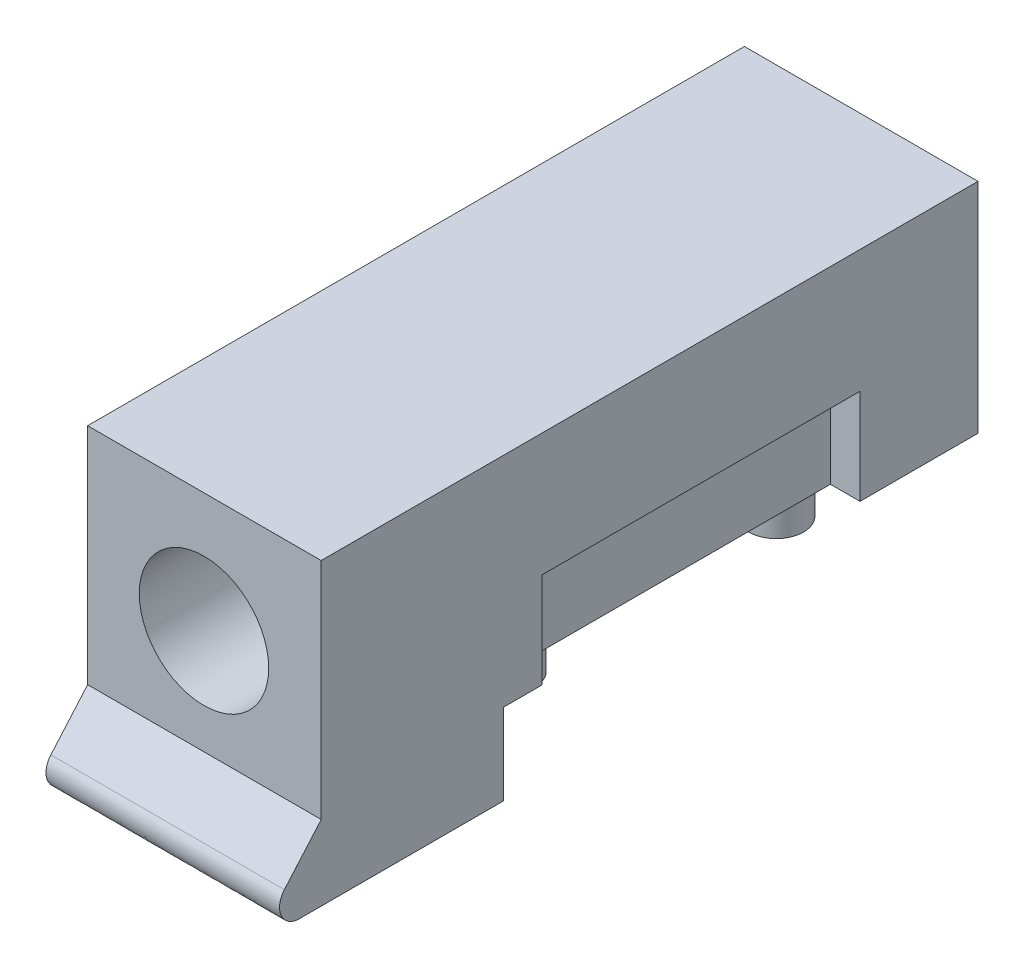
ISO-10303-21;
HEADER;
FILE_DESCRIPTION(('STEP AP214'),'2;1');
FILE_NAME('part.step','',(''),(''),'','','');
FILE_SCHEMA(('AUTOMOTIVE_DESIGN { 1 0 10303 214 1 1 1 1 }'));
ENDSEC;
DATA;
#1=APPLICATION_CONTEXT('core data for automotive mechanical design processes');
#2=APPLICATION_PROTOCOL_DEFINITION('international standard','automotive_design',2000,#1);
#3=PRODUCT_CONTEXT('',#1,'mechanical');
#4=PRODUCT('Part','Part','',(#3));
#5=PRODUCT_RELATED_PRODUCT_CATEGORY('part','',(#4));
#6=PRODUCT_DEFINITION_FORMATION('','',#4);
#7=PRODUCT_DEFINITION_CONTEXT('part definition',#1,'design');
#8=PRODUCT_DEFINITION('design','',#6,#7);
#9=PRODUCT_DEFINITION_SHAPE('','',#8);
#10=(LENGTH_UNIT() NAMED_UNIT(*) SI_UNIT(.MILLI.,.METRE.));
#11=(NAMED_UNIT(*) PLANE_ANGLE_UNIT() SI_UNIT($,.RADIAN.));
#12=(NAMED_UNIT(*) SI_UNIT($,.STERADIAN.) SOLID_ANGLE_UNIT());
#13=UNCERTAINTY_MEASURE_WITH_UNIT(LENGTH_MEASURE(1.E-05),#10,'distance_accuracy_value','');
#14=(GEOMETRIC_REPRESENTATION_CONTEXT(3) GLOBAL_UNCERTAINTY_ASSIGNED_CONTEXT((#13)) GLOBAL_UNIT_ASSIGNED_CONTEXT((#10,
#11,#12)) REPRESENTATION_CONTEXT('',''));
#15=CARTESIAN_POINT('',(0.,0.,0.));
#16=DIRECTION('',(0.,0.,1.));
#17=DIRECTION('',(1.,0.,0.));
#18=AXIS2_PLACEMENT_3D('',#15,#16,#17);
#19=CARTESIAN_POINT('',(-5.518,0.,-62.0626));
#20=DIRECTION('',(0.,1.,0.));
#21=DIRECTION('',(0.,0.,1.));
#22=AXIS2_PLACEMENT_3D('',#19,#20,#21);
#23=PLANE('',#22);
#24=CARTESIAN_POINT('',(0.,0.,-51.13));
#25=DIRECTION('',(0.,-1.,0.));
#26=DIRECTION('',(0.,0.,-1.));
#27=AXIS2_PLACEMENT_3D('',#24,#25,#26);
#28=CIRCLE('',#27,1.);
#29=CARTESIAN_POINT('',(0.,0.,-52.13));
#30=VERTEX_POINT('',#29);
#31=EDGE_CURVE('E553',#30,#30,#28,.T.);
#32=ORIENTED_EDGE('',*,*,#31,.F.);
#33=EDGE_LOOP('',(#32));
#34=FACE_BOUND('',#33,.T.);
#35=CARTESIAN_POINT('',(0.0200000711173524,0.,-45.5));
#36=DIRECTION('',(0.,1.,0.));
#37=DIRECTION('',(0.,0.,1.));
#38=AXIS2_PLACEMENT_3D('',#35,#36,#37);
#39=CIRCLE('',#38,1.25);
#40=CARTESIAN_POINT('',(0.0200000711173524,0.,-44.25));
#41=VERTEX_POINT('',#40);
#42=EDGE_CURVE('E44',#41,#41,#39,.F.);
#43=ORIENTED_EDGE('',*,*,#42,.F.);
#44=EDGE_LOOP('',(#43));
#45=FACE_BOUND('',#44,.T.);
#46=DIRECTION('',(1.,0.,0.));
#47=VECTOR('',#46,1.);
#48=CARTESIAN_POINT('',(-4.63,0.,-41.75));
#49=LINE('',#48,#47);
#50=CARTESIAN_POINT('',(-5.305,0.,-41.75));
#51=VERTEX_POINT('',#50);
#52=CARTESIAN_POINT('',(-3.955,0.,-41.75));
#53=VERTEX_POINT('',#52);
#54=EDGE_CURVE('E278',#51,#53,#49,.T.);
#55=ORIENTED_EDGE('',*,*,#54,.T.);
#56=DIRECTION('',(0.,0.,1.));
#57=VECTOR('',#56,1.);
#58=CARTESIAN_POINT('',(-3.955,0.,-50.815));
#59=LINE('',#58,#57);
#60=CARTESIAN_POINT('',(-3.955,0.,-56.25));
#61=VERTEX_POINT('',#60);
#62=EDGE_CURVE('E247',#61,#53,#59,.T.);
#63=ORIENTED_EDGE('',*,*,#62,.F.);
#64=DIRECTION('',(1.,0.,0.));
#65=VECTOR('',#64,1.);
#66=CARTESIAN_POINT('',(-4.63,0.,-56.25));
#67=LINE('',#66,#65);
#68=CARTESIAN_POINT('',(-5.305,0.,-56.25));
#69=VERTEX_POINT('',#68);
#70=EDGE_CURVE('E435',#61,#69,#67,.F.);
#71=ORIENTED_EDGE('',*,*,#70,.T.);
#72=DIRECTION('',(0.,0.,1.));
#73=VECTOR('',#72,1.);
#74=CARTESIAN_POINT('',(-5.305,0.,-50.815));
#75=LINE('',#74,#73);
#76=CARTESIAN_POINT('',(-5.305,0.,-61.63));
#77=VERTEX_POINT('',#76);
#78=EDGE_CURVE('E417',#77,#69,#75,.T.);
#79=ORIENTED_EDGE('',*,*,#78,.F.);
#80=DIRECTION('',(-1.,0.,0.));
#81=VECTOR('',#80,1.);
#82=CARTESIAN_POINT('',(0.0200000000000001,0.,-61.63));
#83=LINE('',#82,#81);
#84=CARTESIAN_POINT('',(5.345,0.,-61.63));
#85=VERTEX_POINT('',#84);
#86=EDGE_CURVE('E237',#85,#77,#83,.T.);
#87=ORIENTED_EDGE('',*,*,#86,.F.);
#88=DIRECTION('',(0.,0.,-1.));
#89=VECTOR('',#88,1.);
#90=CARTESIAN_POINT('',(5.345,0.,-45.705));
#91=LINE('',#90,#89);
#92=CARTESIAN_POINT('',(5.345,0.,-56.25));
#93=VERTEX_POINT('',#92);
#94=EDGE_CURVE('E60',#85,#93,#91,.F.);
#95=ORIENTED_EDGE('',*,*,#94,.T.);
#96=DIRECTION('',(1.,0.,0.));
#97=VECTOR('',#96,1.);
#98=CARTESIAN_POINT('',(4.67,0.,-56.25));
#99=LINE('',#98,#97);
#100=CARTESIAN_POINT('',(3.995,0.,-56.25));
#101=VERTEX_POINT('',#100);
#102=EDGE_CURVE('E190',#93,#101,#99,.F.);
#103=ORIENTED_EDGE('',*,*,#102,.T.);
#104=DIRECTION('',(0.,0.,-1.));
#105=VECTOR('',#104,1.);
#106=CARTESIAN_POINT('',(3.995,0.,-50.815));
#107=LINE('',#106,#105);
#108=CARTESIAN_POINT('',(3.995,0.,-41.75));
#109=VERTEX_POINT('',#108);
#110=EDGE_CURVE('E197',#109,#101,#107,.T.);
#111=ORIENTED_EDGE('',*,*,#110,.F.);
#112=DIRECTION('',(-1.,0.,0.));
#113=VECTOR('',#112,1.);
#114=CARTESIAN_POINT('',(0.0199999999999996,0.,-41.75));
#115=LINE('',#114,#113);
#116=CARTESIAN_POINT('',(5.345,0.,-41.75));
#117=VERTEX_POINT('',#116);
#118=EDGE_CURVE('E194',#117,#109,#115,.T.);
#119=ORIENTED_EDGE('',*,*,#118,.F.);
#120=DIRECTION('',(0.,0.,-1.));
#121=VECTOR('',#120,1.);
#122=CARTESIAN_POINT('',(5.345,0.,-45.705));
#123=LINE('',#122,#121);
#124=CARTESIAN_POINT('',(5.345,0.,-40.));
#125=VERTEX_POINT('',#124);
#126=EDGE_CURVE('E180',#117,#125,#123,.F.);
#127=ORIENTED_EDGE('',*,*,#126,.T.);
#128=DIRECTION('',(1.,0.,0.));
#129=VECTOR('',#128,1.);
#130=CARTESIAN_POINT('',(0.0199999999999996,0.,-40.));
#131=LINE('',#130,#129);
#132=CARTESIAN_POINT('',(-5.305,0.,-40.));
#133=VERTEX_POINT('',#132);
#134=EDGE_CURVE('E188',#133,#125,#131,.T.);
#135=ORIENTED_EDGE('',*,*,#134,.F.);
#136=DIRECTION('',(0.,0.,1.));
#137=VECTOR('',#136,1.);
#138=CARTESIAN_POINT('',(-5.305,0.,-50.815));
#139=LINE('',#138,#137);
#140=EDGE_CURVE('E191',#51,#133,#139,.T.);
#141=ORIENTED_EDGE('',*,*,#140,.F.);
#142=EDGE_LOOP('',(#55,#63,#71,#79,#87,#95,#103,#111,#119,#127,#135,#141));
#143=FACE_BOUND('',#142,.T.);
#144=CARTESIAN_POINT('',(0.0200000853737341,0.,-57.75));
#145=DIRECTION('',(0.,1.,0.));
#146=DIRECTION('',(0.,0.,1.));
#147=AXIS2_PLACEMENT_3D('',#144,#145,#146);
#148=CIRCLE('',#147,1.25);
#149=CARTESIAN_POINT('',(0.0200000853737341,0.,-56.5));
#150=VERTEX_POINT('',#149);
#151=EDGE_CURVE('E11',#150,#150,#148,.F.);
#152=ORIENTED_EDGE('',*,*,#151,.F.);
#153=EDGE_LOOP('',(#152));
#154=FACE_BOUND('',#153,.T.);
#155=ADVANCED_FACE('F30',(#34,#45,#143,#154),#23,.F.);
#156=CARTESIAN_POINT('',(-5.351126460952,4.35,-41.46));
#157=DIRECTION('',(0.,1.,0.));
#158=DIRECTION('',(1.,0.,0.));
#159=AXIS2_PLACEMENT_3D('',#156,#157,#158);
#160=PLANE('',#159);
#161=DIRECTION('',(0.,0.,1.));
#162=VECTOR('',#161,1.);
#163=CARTESIAN_POINT('',(-3.955,4.35,-49.));
#164=LINE('',#163,#162);
#165=CARTESIAN_POINT('',(-3.955,4.35,-56.25));
#166=VERTEX_POINT('',#165);
#167=CARTESIAN_POINT('',(-3.955,4.35,-41.75));
#168=VERTEX_POINT('',#167);
#169=EDGE_CURVE('E413',#166,#168,#164,.T.);
#170=ORIENTED_EDGE('',*,*,#169,.T.);
#171=DIRECTION('',(-1.,0.,0.));
#172=VECTOR('',#171,1.);
#173=CARTESIAN_POINT('',(-4.63,4.35,-41.75));
#174=LINE('',#173,#172);
#175=CARTESIAN_POINT('',(-5.305,4.35,-41.75));
#176=VERTEX_POINT('',#175);
#177=EDGE_CURVE('E443',#168,#176,#174,.T.);
#178=ORIENTED_EDGE('',*,*,#177,.T.);
#179=DIRECTION('',(0.,0.,-1.));
#180=VECTOR('',#179,1.);
#181=CARTESIAN_POINT('',(-5.305,4.35,-45.705));
#182=LINE('',#181,#180);
#183=CARTESIAN_POINT('',(-5.305,4.35,-56.25));
#184=VERTEX_POINT('',#183);
#185=EDGE_CURVE('E422',#176,#184,#182,.T.);
#186=ORIENTED_EDGE('',*,*,#185,.T.);
#187=DIRECTION('',(-1.,0.,0.));
#188=VECTOR('',#187,1.);
#189=CARTESIAN_POINT('',(-4.63,4.35,-56.25));
#190=LINE('',#189,#188);
#191=EDGE_CURVE('E433',#184,#166,#190,.F.);
#192=ORIENTED_EDGE('',*,*,#191,.T.);
#193=EDGE_LOOP('',(#170,#178,#186,#192));
#194=FACE_BOUND('',#193,.T.);
#195=ADVANCED_FACE('F271',(#194),#160,.F.);
#196=CARTESIAN_POINT('',(-5.351126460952,-0.087,-56.25));
#197=DIRECTION('',(0.,0.,1.));
#198=DIRECTION('',(1.,0.,0.));
#199=AXIS2_PLACEMENT_3D('',#196,#197,#198);
#200=PLANE('',#199);
#201=DIRECTION('',(0.,1.,0.));
#202=VECTOR('',#201,1.);
#203=CARTESIAN_POINT('',(-3.955,2.175,-56.25));
#204=LINE('',#203,#202);
#205=EDGE_CURVE('E410',#61,#166,#204,.T.);
#206=ORIENTED_EDGE('',*,*,#205,.T.);
#207=ORIENTED_EDGE('',*,*,#191,.F.);
#208=DIRECTION('',(0.,-1.,0.));
#209=VECTOR('',#208,1.);
#210=CARTESIAN_POINT('',(-5.305,5.5,-56.25));
#211=LINE('',#210,#209);
#212=EDGE_CURVE('E428',#184,#69,#211,.T.);
#213=ORIENTED_EDGE('',*,*,#212,.T.);
#214=ORIENTED_EDGE('',*,*,#70,.F.);
#215=EDGE_LOOP('',(#206,#207,#213,#214));
#216=FACE_BOUND('',#215,.T.);
#217=ADVANCED_FACE('F311',(#216),#200,.T.);
#218=CARTESIAN_POINT('',(-3.908873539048,4.437,-41.75));
#219=DIRECTION('',(0.,0.,1.));
#220=DIRECTION('',(-1.,0.,0.));
#221=AXIS2_PLACEMENT_3D('',#218,#219,#220);
#222=PLANE('',#221);
#223=DIRECTION('',(0.,-1.,0.));
#224=VECTOR('',#223,1.);
#225=CARTESIAN_POINT('',(-3.955,2.175,-41.75));
#226=LINE('',#225,#224);
#227=EDGE_CURVE('E420',#168,#53,#226,.T.);
#228=ORIENTED_EDGE('',*,*,#227,.T.);
#229=ORIENTED_EDGE('',*,*,#54,.F.);
#230=DIRECTION('',(0.,1.,0.));
#231=VECTOR('',#230,1.);
#232=CARTESIAN_POINT('',(-5.305,5.5,-41.75));
#233=LINE('',#232,#231);
#234=EDGE_CURVE('E227',#51,#176,#233,.T.);
#235=ORIENTED_EDGE('',*,*,#234,.T.);
#236=ORIENTED_EDGE('',*,*,#177,.F.);
#237=EDGE_LOOP('',(#228,#229,#235,#236));
#238=FACE_BOUND('',#237,.T.);
#239=ADVANCED_FACE('F315',(#238),#222,.F.);
#240=CARTESIAN_POINT('',(5.558,-3.698818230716,-30.72610626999));
#241=CARTESIAN_POINT('',(1.866,-3.698818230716,-30.72610626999));
#242=CARTESIAN_POINT('',(-1.826,-3.698818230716,-30.72610626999));
#243=CARTESIAN_POINT('',(-5.518,-3.698818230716,-30.72610626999));
#244=CARTESIAN_POINT('',(5.558,-3.703407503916,-30.63664072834));
#245=CARTESIAN_POINT('',(1.866,-3.703407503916,-30.63664072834));
#246=CARTESIAN_POINT('',(-1.826,-3.703407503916,-30.63664072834));
#247=CARTESIAN_POINT('',(-5.518,-3.703407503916,-30.63664072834));
#248=CARTESIAN_POINT('',(5.558,-3.685670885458,-30.45634286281));
#249=CARTESIAN_POINT('',(1.866,-3.685670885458,-30.45634286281));
#250=CARTESIAN_POINT('',(-1.826,-3.685670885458,-30.45634286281));
#251=CARTESIAN_POINT('',(-5.518,-3.685670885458,-30.45634286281));
#252=CARTESIAN_POINT('',(5.558,-3.580677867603,-30.20568047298));
#253=CARTESIAN_POINT('',(1.866,-3.580677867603,-30.20568047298));
#254=CARTESIAN_POINT('',(-1.826,-3.580677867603,-30.20568047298));
#255=CARTESIAN_POINT('',(-5.518,-3.580677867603,-30.20568047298));
#256=CARTESIAN_POINT('',(5.558,-3.40658871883,-29.99700194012));
#257=CARTESIAN_POINT('',(1.866,-3.40658871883,-29.99700194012));
#258=CARTESIAN_POINT('',(-1.826,-3.40658871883,-29.99700194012));
#259=CARTESIAN_POINT('',(-5.518,-3.40658871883,-29.99700194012));
#260=CARTESIAN_POINT('',(5.558,-3.178811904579,-29.84877313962));
#261=CARTESIAN_POINT('',(1.866,-3.178811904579,-29.84877313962));
#262=CARTESIAN_POINT('',(-1.826,-3.178811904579,-29.84877313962));
#263=CARTESIAN_POINT('',(-5.518,-3.178811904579,-29.84877313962));
#264=CARTESIAN_POINT('',(5.558,-2.917507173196,-29.77411463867));
#265=CARTESIAN_POINT('',(1.866,-2.917507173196,-29.77411463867));
#266=CARTESIAN_POINT('',(-1.826,-2.917507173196,-29.77411463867));
#267=CARTESIAN_POINT('',(-5.518,-2.917507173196,-29.77411463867));
#268=CARTESIAN_POINT('',(5.558,-2.645802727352,-29.77963332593));
#269=CARTESIAN_POINT('',(1.866,-2.645802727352,-29.77963332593));
#270=CARTESIAN_POINT('',(-1.826,-2.645802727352,-29.77963332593));
#271=CARTESIAN_POINT('',(-5.518,-2.645802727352,-29.77963332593));
#272=CARTESIAN_POINT('',(5.558,-2.387743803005,-29.86484341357));
#273=CARTESIAN_POINT('',(1.866,-2.387743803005,-29.86484341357));
#274=CARTESIAN_POINT('',(-1.826,-2.387743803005,-29.86484341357));
#275=CARTESIAN_POINT('',(-5.518,-2.387743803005,-29.86484341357));
#276=CARTESIAN_POINT('',(5.558,-2.240035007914,-29.96974346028));
#277=CARTESIAN_POINT('',(1.866,-2.240035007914,-29.96974346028));
#278=CARTESIAN_POINT('',(-1.826,-2.240035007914,-29.96974346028));
#279=CARTESIAN_POINT('',(-5.518,-2.240035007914,-29.96974346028));
#280=CARTESIAN_POINT('',(5.558,-2.17552534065,-30.03190170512));
#281=CARTESIAN_POINT('',(1.866,-2.17552534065,-30.03190170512));
#282=CARTESIAN_POINT('',(-1.826,-2.17552534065,-30.03190170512));
#283=CARTESIAN_POINT('',(-5.518,-2.17552534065,-30.03190170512));
#284=B_SPLINE_SURFACE_WITH_KNOTS('',3,3,((#240,#241,#242,#243),(#244,#245,#246,#247),(#248,#249,
#250,#251),(#252,#253,#254,#255),(#256,#257,#258,#259),(#260,#261,#262,#263),(#264,#265,#266,
#267),(#268,#269,#270,#271),(#272,#273,#274,#275),(#276,#277,#278,#279),(#280,#281,#282,#283)),
.UNSPECIFIED.,.F.,.F.,.F.,(4,1,1,1,1,1,1,1,4),(4,4),(4.661137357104,4.959747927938,
5.258358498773,5.556969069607,5.855579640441,6.154190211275,6.452800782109,6.751411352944,
7.050021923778),(0.,11.076),.UNSPECIFIED.);
#285=CARTESIAN_POINT('',(5.558,-2.20955085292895,-30.0007659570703));
#286=CARTESIAN_POINT('',(1.866,-2.20955085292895,-30.0007659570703));
#287=CARTESIAN_POINT('',(-1.826,-2.20955085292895,-30.0007659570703));
#288=CARTESIAN_POINT('',(-5.518,-2.20955085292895,-30.0007659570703));
#289=B_SPLINE_CURVE_WITH_KNOTS('',3,(#285,#286,#287,#288),.UNSPECIFIED.,.F.,.F.,(4,4),(0.,
11.076),.UNSPECIFIED.);
#290=CARTESIAN_POINT('',(5.345,-2.20954886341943,-30.0007636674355));
#291=VERTEX_POINT('',#290);
#292=CARTESIAN_POINT('',(-5.305,-2.20954886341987,-30.000763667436));
#293=VERTEX_POINT('',#292);
#294=EDGE_CURVE('E146',#291,#293,#289,.T.);
#295=CARTESIAN_POINT('',(-5.305,-2.20955085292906,-30.0007659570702));
#296=CARTESIAN_POINT('',(-5.305,-2.22864470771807,-29.9841754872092));
#297=CARTESIAN_POINT('',(-5.305,-2.2484373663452,-29.9683911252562));
#298=CARTESIAN_POINT('',(-5.305,-2.28927631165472,-29.9385380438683));
#299=CARTESIAN_POINT('',(-5.305,-2.31032257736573,-29.924469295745));
#300=CARTESIAN_POINT('',(-5.305,-2.35357081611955,-29.8981226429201));
#301=CARTESIAN_POINT('',(-5.305,-2.3757751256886,-29.8858485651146));
#302=CARTESIAN_POINT('',(-5.305,-2.42113949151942,-29.8632346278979));
#303=CARTESIAN_POINT('',(-5.305,-2.44429950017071,-29.8528946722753));
#304=CARTESIAN_POINT('',(-5.305,-2.5149818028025,-29.8248429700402));
#305=CARTESIAN_POINT('',(-5.305,-2.56371636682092,-29.8100933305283));
#306=CARTESIAN_POINT('',(-5.305,-2.66283289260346,-29.7890814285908));
#307=CARTESIAN_POINT('',(-5.305,-2.71320884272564,-29.7827911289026));
#308=CARTESIAN_POINT('',(-5.305,-2.77577573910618,-29.7802626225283));
#309=CARTESIAN_POINT('',(-5.305,-2.78788468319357,-29.780018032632));
#310=CARTESIAN_POINT('',(-5.305,-2.85046925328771,-29.7800192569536));
#311=CARTESIAN_POINT('',(-5.305,-2.90104911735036,-29.7842688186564));
#312=CARTESIAN_POINT('',(-5.305,-2.97580043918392,-29.7969783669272));
#313=CARTESIAN_POINT('',(-5.305,-3.00057006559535,-29.8022844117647));
#314=CARTESIAN_POINT('',(-5.305,-3.04959531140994,-29.8149529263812));
#315=CARTESIAN_POINT('',(-5.305,-3.07385066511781,-29.8223164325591));
#316=CARTESIAN_POINT('',(-5.305,-3.14542713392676,-29.8474068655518));
#317=CARTESIAN_POINT('',(-5.305,-3.19172441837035,-29.8681619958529));
#318=CARTESIAN_POINT('',(-5.305,-3.2802421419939,-29.9171657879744));
#319=CARTESIAN_POINT('',(-5.305,-3.32245542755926,-29.9454272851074));
#320=CARTESIAN_POINT('',(-5.305,-3.40155107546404,-30.0086693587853));
#321=CARTESIAN_POINT('',(-5.305,-3.43843056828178,-30.0436535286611));
#322=CARTESIAN_POINT('',(-5.305,-3.50574845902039,-30.1192421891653));
#323=CARTESIAN_POINT('',(-5.305,-3.53619779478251,-30.1598369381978));
#324=CARTESIAN_POINT('',(-5.305,-3.589843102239,-30.2455974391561));
#325=CARTESIAN_POINT('',(-5.305,-3.61303428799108,-30.2907661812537));
#326=CARTESIAN_POINT('',(-5.305,-3.65153143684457,-30.3843377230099));
#327=CARTESIAN_POINT('',(-5.305,-3.66684156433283,-30.4327387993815));
#328=CARTESIAN_POINT('',(-5.305,-3.68528292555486,-30.5145326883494));
#329=CARTESIAN_POINT('',(-5.305,-3.69078744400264,-30.5474093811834));
#330=CARTESIAN_POINT('',(-5.305,-3.69813347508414,-30.613520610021));
#331=CARTESIAN_POINT('',(-5.305,-3.69998039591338,-30.646754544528));
#332=CARTESIAN_POINT('',(-5.305,-3.69999393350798,-30.680000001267));
#333=B_SPLINE_CURVE_WITH_KNOTS('',3,(#295,#296,#297,#298,#299,#300,#301,#302,#303,#304,#305,
#306,#307,#308,#309,#310,#311,#312,#313,#314,#315,#316,#317,#318,#319,#320,#321,#322,#323,#324,
#325,#326,#327,#328,#329,#330,#331,#332),.UNSPECIFIED.,.F.,.F.,(4,2,2,2,2,2,2,2,2,2,2,2,2,2,2,2,
2,2,4),(0.,0.0758594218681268,0.151717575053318,0.227735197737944,0.303749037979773,
0.455742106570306,0.607230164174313,0.643565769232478,0.794930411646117,0.87085735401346,
0.946822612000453,1.0982551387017,1.24994828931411,1.40172274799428,1.55323691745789,
1.70485078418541,1.85638445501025,1.95619626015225,2.05586037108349),.UNSPECIFIED.);
#334=CARTESIAN_POINT('',(-5.305,-3.69999696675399,-30.6800000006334));
#335=VERTEX_POINT('',#334);
#336=EDGE_CURVE('E252',#293,#335,#333,.T.);
#337=CARTESIAN_POINT('',(-5.518,-3.69999393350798,-30.6800000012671));
#338=CARTESIAN_POINT('',(-1.826,-3.69999393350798,-30.6800000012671));
#339=CARTESIAN_POINT('',(1.866,-3.69999393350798,-30.6800000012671));
#340=CARTESIAN_POINT('',(5.558,-3.69999393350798,-30.6800000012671));
#341=B_SPLINE_CURVE_WITH_KNOTS('',3,(#337,#338,#339,#340),.UNSPECIFIED.,.F.,.F.,(4,4),(0.,
11.076),.UNSPECIFIED.);
#342=CARTESIAN_POINT('',(5.345,-3.69999696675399,-30.6800000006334));
#343=VERTEX_POINT('',#342);
#344=EDGE_CURVE('E407',#335,#343,#341,.T.);
#345=CARTESIAN_POINT('',(5.345,-2.20955085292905,-30.0007659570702));
#346=CARTESIAN_POINT('',(5.345,-2.22864470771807,-29.9841754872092));
#347=CARTESIAN_POINT('',(5.345,-2.24843736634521,-29.9683911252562));
#348=CARTESIAN_POINT('',(5.345,-2.28927631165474,-29.9385380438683));
#349=CARTESIAN_POINT('',(5.345,-2.31032257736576,-29.924469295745));
#350=CARTESIAN_POINT('',(5.345,-2.3535708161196,-29.89812264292));
#351=CARTESIAN_POINT('',(5.345,-2.37577512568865,-29.8858485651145));
#352=CARTESIAN_POINT('',(5.345,-2.42113949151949,-29.8632346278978));
#353=CARTESIAN_POINT('',(5.345,-2.44429950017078,-29.8528946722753));
#354=CARTESIAN_POINT('',(5.345,-2.5149818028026,-29.8248429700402));
#355=CARTESIAN_POINT('',(5.345,-2.56371636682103,-29.8100933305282));
#356=CARTESIAN_POINT('',(5.345,-2.66283289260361,-29.7890814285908));
#357=CARTESIAN_POINT('',(5.345,-2.7132088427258,-29.7827911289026));
#358=CARTESIAN_POINT('',(5.345,-2.7757757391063,-29.7802626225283));
#359=CARTESIAN_POINT('',(5.345,-2.78788468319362,-29.780018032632));
#360=CARTESIAN_POINT('',(5.345,-2.85046925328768,-29.7800192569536));
#361=CARTESIAN_POINT('',(5.345,-2.90104911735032,-29.7842688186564));
#362=CARTESIAN_POINT('',(5.345,-2.97580043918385,-29.7969783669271));
#363=CARTESIAN_POINT('',(5.345,-3.00057006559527,-29.8022844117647));
#364=CARTESIAN_POINT('',(5.345,-3.04959531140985,-29.8149529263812));
#365=CARTESIAN_POINT('',(5.345,-3.07385066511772,-29.8223164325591));
#366=CARTESIAN_POINT('',(5.345,-3.14542713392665,-29.8474068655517));
#367=CARTESIAN_POINT('',(5.345,-3.19172441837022,-29.8681619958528));
#368=CARTESIAN_POINT('',(5.345,-3.28024214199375,-29.9171657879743));
#369=CARTESIAN_POINT('',(5.345,-3.32245542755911,-29.9454272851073));
#370=CARTESIAN_POINT('',(5.345,-3.40155107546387,-30.0086693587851));
#371=CARTESIAN_POINT('',(5.345,-3.43843056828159,-30.0436535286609));
#372=CARTESIAN_POINT('',(5.345,-3.50574845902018,-30.1192421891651));
#373=CARTESIAN_POINT('',(5.345,-3.5361977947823,-30.1598369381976));
#374=CARTESIAN_POINT('',(5.345,-3.58984310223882,-30.2455974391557));
#375=CARTESIAN_POINT('',(5.345,-3.61303428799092,-30.2907661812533));
#376=CARTESIAN_POINT('',(5.345,-3.65153143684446,-30.3843377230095));
#377=CARTESIAN_POINT('',(5.345,-3.66684156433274,-30.4327387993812));
#378=CARTESIAN_POINT('',(5.345,-3.68528292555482,-30.5145326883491));
#379=CARTESIAN_POINT('',(5.345,-3.69078744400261,-30.5474093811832));
#380=CARTESIAN_POINT('',(5.345,-3.69813347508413,-30.6135206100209));
#381=CARTESIAN_POINT('',(5.345,-3.69998039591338,-30.646754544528));
#382=CARTESIAN_POINT('',(5.345,-3.69999393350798,-30.680000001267));
#383=B_SPLINE_CURVE_WITH_KNOTS('',3,(#345,#346,#347,#348,#349,#350,#351,#352,#353,#354,#355,
#356,#357,#358,#359,#360,#361,#362,#363,#364,#365,#366,#367,#368,#369,#370,#371,#372,#373,#374,
#375,#376,#377,#378,#379,#380,#381,#382),.UNSPECIFIED.,.F.,.F.,(4,2,2,2,2,2,2,2,2,2,2,2,2,2,2,2,
2,2,4),(0.,0.0758594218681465,0.151717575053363,0.227735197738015,0.303749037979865,
0.455742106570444,0.607230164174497,0.643565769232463,0.794930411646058,0.870857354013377,
0.946822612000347,1.09825513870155,1.24994828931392,1.40172274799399,1.5532369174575,
1.70485078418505,1.85638445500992,1.95619626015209,2.0558603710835),.UNSPECIFIED.);
#384=EDGE_CURVE('E355',#291,#343,#383,.T.);
#385=ORIENTED_EDGE('',*,*,#294,.T.);
#386=ORIENTED_EDGE('',*,*,#336,.T.);
#387=ORIENTED_EDGE('',*,*,#344,.T.);
#388=ORIENTED_EDGE('',*,*,#384,.F.);
#389=EDGE_LOOP('',(#385,#386,#387,#388));
#390=FACE_BOUND('',#389,.T.);
#391=ADVANCED_FACE('F319',(#390),#284,.T.);
#392=CARTESIAN_POINT('',(-3.955,4.437,-56.54));
#393=DIRECTION('',(1.,0.,0.));
#394=DIRECTION('',(0.,0.,1.));
#395=AXIS2_PLACEMENT_3D('',#392,#393,#394);
#396=PLANE('',#395);
#397=ORIENTED_EDGE('',*,*,#169,.F.);
#398=ORIENTED_EDGE('',*,*,#205,.F.);
#399=ORIENTED_EDGE('',*,*,#62,.T.);
#400=ORIENTED_EDGE('',*,*,#227,.F.);
#401=EDGE_LOOP('',(#397,#398,#399,#400));
#402=FACE_BOUND('',#401,.T.);
#403=ADVANCED_FACE('F326',(#402),#396,.F.);
#404=CARTESIAN_POINT('',(-5.305,15.068,-62.267));
#405=DIRECTION('',(1.,0.,0.));
#406=DIRECTION('',(0.,0.,1.));
#407=AXIS2_PLACEMENT_3D('',#404,#405,#406);
#408=PLANE('',#407);
#409=DIRECTION('',(0.,-1.,0.));
#410=VECTOR('',#409,1.);
#411=CARTESIAN_POINT('',(-5.305,5.49999999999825,-31.68));
#412=LINE('',#411,#410);
#413=CARTESIAN_POINT('',(-5.305,-0.277803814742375,-31.679999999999));
#414=VERTEX_POINT('',#413);
#415=CARTESIAN_POINT('',(-5.305,9.95,-31.68));
#416=VERTEX_POINT('',#415);
#417=EDGE_CURVE('E157',#414,#416,#412,.F.);
#418=ORIENTED_EDGE('',*,*,#417,.T.);
#419=DIRECTION('',(0.,0.,1.));
#420=VECTOR('',#419,1.);
#421=CARTESIAN_POINT('',(-5.305,9.95,-68.2273435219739));
#422=LINE('',#421,#420);
#423=CARTESIAN_POINT('',(-5.305,9.95,-61.63));
#424=VERTEX_POINT('',#423);
#425=EDGE_CURVE('E469',#424,#416,#422,.T.);
#426=ORIENTED_EDGE('',*,*,#425,.F.);
#427=DIRECTION('',(0.,-1.,0.));
#428=VECTOR('',#427,1.);
#429=CARTESIAN_POINT('',(-5.305,7.35,-61.63));
#430=LINE('',#429,#428);
#431=EDGE_CURVE('E198',#424,#77,#430,.T.);
#432=ORIENTED_EDGE('',*,*,#431,.T.);
#433=ORIENTED_EDGE('',*,*,#78,.T.);
#434=ORIENTED_EDGE('',*,*,#212,.F.);
#435=ORIENTED_EDGE('',*,*,#185,.F.);
#436=ORIENTED_EDGE('',*,*,#234,.F.);
#437=ORIENTED_EDGE('',*,*,#140,.T.);
#438=DIRECTION('',(0.,-1.,0.));
#439=VECTOR('',#438,1.);
#440=CARTESIAN_POINT('',(-5.305,-1.85,-40.));
#441=LINE('',#440,#439);
#442=CARTESIAN_POINT('',(-5.305,-3.7,-40.));
#443=VERTEX_POINT('',#442);
#444=EDGE_CURVE('E175',#133,#443,#441,.T.);
#445=ORIENTED_EDGE('',*,*,#444,.T.);
#446=DIRECTION('',(0.,0.,1.));
#447=VECTOR('',#446,1.);
#448=CARTESIAN_POINT('',(-5.305,-3.7,-35.34));
#449=LINE('',#448,#447);
#450=EDGE_CURVE('E174',#443,#335,#449,.T.);
#451=ORIENTED_EDGE('',*,*,#450,.T.);
#452=ORIENTED_EDGE('',*,*,#336,.F.);
#453=DIRECTION('',(0.,-0.754709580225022,0.656059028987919));
#454=VECTOR('',#453,1.);
#455=CARTESIAN_POINT('',(-5.305,-1.24367534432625,-30.8403806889));
#456=LINE('',#455,#454);
#457=EDGE_CURVE('E158',#293,#414,#456,.F.);
#458=ORIENTED_EDGE('',*,*,#457,.T.);
#459=EDGE_LOOP('',(#418,#426,#432,#433,#434,#435,#436,#437,#445,#451,#452,#458));
#460=FACE_BOUND('',#459,.T.);
#461=ADVANCED_FACE('F356',(#460),#408,.F.);
#462=CARTESIAN_POINT('',(3.995,-0.087,-41.46));
#463=DIRECTION('',(1.,0.,0.));
#464=DIRECTION('',(0.,0.,-1.));
#465=AXIS2_PLACEMENT_3D('',#462,#463,#464);
#466=PLANE('',#465);
#467=DIRECTION('',(0.,0.,1.));
#468=VECTOR('',#467,1.);
#469=CARTESIAN_POINT('',(3.995,4.35,-49.));
#470=LINE('',#469,#468);
#471=CARTESIAN_POINT('',(3.995,4.35,-56.25));
#472=VERTEX_POINT('',#471);
#473=CARTESIAN_POINT('',(3.995,4.35,-41.75));
#474=VERTEX_POINT('',#473);
#475=EDGE_CURVE('E209',#472,#474,#470,.T.);
#476=ORIENTED_EDGE('',*,*,#475,.T.);
#477=DIRECTION('',(0.,-1.,0.));
#478=VECTOR('',#477,1.);
#479=CARTESIAN_POINT('',(3.995,2.175,-41.75));
#480=LINE('',#479,#478);
#481=EDGE_CURVE('E208',#474,#109,#480,.T.);
#482=ORIENTED_EDGE('',*,*,#481,.T.);
#483=ORIENTED_EDGE('',*,*,#110,.T.);
#484=DIRECTION('',(0.,-1.,0.));
#485=VECTOR('',#484,1.);
#486=CARTESIAN_POINT('',(3.995,2.175,-56.25));
#487=LINE('',#486,#485);
#488=EDGE_CURVE('E223',#101,#472,#487,.F.);
#489=ORIENTED_EDGE('',*,*,#488,.T.);
#490=EDGE_LOOP('',(#476,#482,#483,#489));
#491=FACE_BOUND('',#490,.T.);
#492=ADVANCED_FACE('F360',(#491),#466,.T.);
#493=CARTESIAN_POINT('',(3.948873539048,4.35,-41.46));
#494=DIRECTION('',(0.,1.,0.));
#495=DIRECTION('',(1.,0.,0.));
#496=AXIS2_PLACEMENT_3D('',#493,#494,#495);
#497=PLANE('',#496);
#498=ORIENTED_EDGE('',*,*,#475,.F.);
#499=DIRECTION('',(-1.,0.,0.));
#500=VECTOR('',#499,1.);
#501=CARTESIAN_POINT('',(4.67,4.35,-56.25));
#502=LINE('',#501,#500);
#503=CARTESIAN_POINT('',(5.345,4.35,-56.25));
#504=VERTEX_POINT('',#503);
#505=EDGE_CURVE('E213',#472,#504,#502,.F.);
#506=ORIENTED_EDGE('',*,*,#505,.T.);
#507=DIRECTION('',(0.,0.,-1.));
#508=VECTOR('',#507,1.);
#509=CARTESIAN_POINT('',(5.345,4.35,-45.705));
#510=LINE('',#509,#508);
#511=CARTESIAN_POINT('',(5.345,4.35,-41.75));
#512=VERTEX_POINT('',#511);
#513=EDGE_CURVE('E202',#504,#512,#510,.F.);
#514=ORIENTED_EDGE('',*,*,#513,.T.);
#515=DIRECTION('',(-1.,0.,0.));
#516=VECTOR('',#515,1.);
#517=CARTESIAN_POINT('',(4.67,4.35,-41.75));
#518=LINE('',#517,#516);
#519=EDGE_CURVE('E205',#512,#474,#518,.T.);
#520=ORIENTED_EDGE('',*,*,#519,.T.);
#521=EDGE_LOOP('',(#498,#506,#514,#520));
#522=FACE_BOUND('',#521,.T.);
#523=ADVANCED_FACE('F364',(#522),#497,.F.);
#524=CARTESIAN_POINT('',(5.391126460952,4.437,-41.75));
#525=DIRECTION('',(0.,0.,1.));
#526=DIRECTION('',(-1.,0.,0.));
#527=AXIS2_PLACEMENT_3D('',#524,#525,#526);
#528=PLANE('',#527);
#529=ORIENTED_EDGE('',*,*,#481,.F.);
#530=ORIENTED_EDGE('',*,*,#519,.F.);
#531=DIRECTION('',(0.,1.,0.));
#532=VECTOR('',#531,1.);
#533=CARTESIAN_POINT('',(5.345,5.5,-41.75));
#534=LINE('',#533,#532);
#535=EDGE_CURVE('E185',#512,#117,#534,.F.);
#536=ORIENTED_EDGE('',*,*,#535,.T.);
#537=ORIENTED_EDGE('',*,*,#118,.T.);
#538=EDGE_LOOP('',(#529,#530,#536,#537));
#539=FACE_BOUND('',#538,.T.);
#540=ADVANCED_FACE('F368',(#539),#528,.F.);
#541=CARTESIAN_POINT('',(-5.518,0.074,-40.));
#542=DIRECTION('',(0.,0.,1.));
#543=DIRECTION('',(0.,-1.,0.));
#544=AXIS2_PLACEMENT_3D('',#541,#542,#543);
#545=PLANE('',#544);
#546=ORIENTED_EDGE('',*,*,#444,.F.);
#547=ORIENTED_EDGE('',*,*,#134,.T.);
#548=DIRECTION('',(0.,1.,0.));
#549=VECTOR('',#548,1.);
#550=CARTESIAN_POINT('',(5.345,5.5,-40.));
#551=LINE('',#550,#549);
#552=CARTESIAN_POINT('',(5.345,-3.7,-40.));
#553=VERTEX_POINT('',#552);
#554=EDGE_CURVE('E178',#125,#553,#551,.F.);
#555=ORIENTED_EDGE('',*,*,#554,.T.);
#556=DIRECTION('',(-1.,0.,0.));
#557=VECTOR('',#556,1.);
#558=CARTESIAN_POINT('',(0.0199999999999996,-3.7,-40.));
#559=LINE('',#558,#557);
#560=EDGE_CURVE('E171',#553,#443,#559,.T.);
#561=ORIENTED_EDGE('',*,*,#560,.T.);
#562=EDGE_LOOP('',(#546,#547,#555,#561));
#563=FACE_BOUND('',#562,.T.);
#564=ADVANCED_FACE('F372',(#563),#545,.F.);
#565=CARTESIAN_POINT('',(-5.518,-3.7,-40.1864));
#566=DIRECTION('',(0.,1.,0.));
#567=DIRECTION('',(0.,0.,1.));
#568=AXIS2_PLACEMENT_3D('',#565,#566,#567);
#569=PLANE('',#568);
#570=ORIENTED_EDGE('',*,*,#450,.F.);
#571=ORIENTED_EDGE('',*,*,#560,.F.);
#572=DIRECTION('',(0.,0.,-1.));
#573=VECTOR('',#572,1.);
#574=CARTESIAN_POINT('',(5.345,-3.7,-45.705));
#575=LINE('',#574,#573);
#576=EDGE_CURVE('E151',#553,#343,#575,.F.);
#577=ORIENTED_EDGE('',*,*,#576,.T.);
#578=ORIENTED_EDGE('',*,*,#344,.F.);
#579=EDGE_LOOP('',(#570,#571,#577,#578));
#580=FACE_BOUND('',#579,.T.);
#581=ADVANCED_FACE('F376',(#580),#569,.F.);
#582=CARTESIAN_POINT('',(5.558,-2.248181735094,-29.96717660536));
#583=DIRECTION('',(0.,0.656059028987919,0.754709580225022));
#584=DIRECTION('',(0.,0.754709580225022,-0.656059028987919));
#585=AXIS2_PLACEMENT_3D('',#582,#583,#584);
#586=PLANE('',#585);
#587=ORIENTED_EDGE('',*,*,#457,.F.);
#588=ORIENTED_EDGE('',*,*,#294,.F.);
#589=DIRECTION('',(0.,0.754709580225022,-0.656059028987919));
#590=VECTOR('',#589,1.);
#591=CARTESIAN_POINT('',(5.345,-2.248181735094,-29.96717660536));
#592=LINE('',#591,#590);
#593=CARTESIAN_POINT('',(5.345,-0.277803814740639,-31.6799999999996));
#594=VERTEX_POINT('',#593);
#595=EDGE_CURVE('E139',#291,#594,#592,.T.);
#596=ORIENTED_EDGE('',*,*,#595,.T.);
#597=DIRECTION('',(1.,0.,0.));
#598=VECTOR('',#597,1.);
#599=CARTESIAN_POINT('',(0.0199999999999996,-0.2778038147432,-31.68));
#600=LINE('',#599,#598);
#601=EDGE_CURVE('E143',#594,#414,#600,.F.);
#602=ORIENTED_EDGE('',*,*,#601,.T.);
#603=EDGE_LOOP('',(#587,#588,#596,#602));
#604=FACE_BOUND('',#603,.T.);
#605=ADVANCED_FACE('F142',(#604),#586,.T.);
#606=CARTESIAN_POINT('',(5.558,-0.5089159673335,-31.68));
#607=DIRECTION('',(0.,0.,1.));
#608=DIRECTION('',(0.,1.,0.));
#609=AXIS2_PLACEMENT_3D('',#606,#607,#608);
#610=PLANE('',#609);
#611=CARTESIAN_POINT('',(0.,4.5,-31.68));
#612=DIRECTION('',(0.,0.,1.));
#613=DIRECTION('',(1.,0.,0.));
#614=AXIS2_PLACEMENT_3D('',#611,#612,#613);
#615=CIRCLE('',#614,2.95);
#616=CARTESIAN_POINT('',(2.95,4.5,-31.68));
#617=VERTEX_POINT('',#616);
#618=EDGE_CURVE('E565',#617,#617,#615,.T.);
#619=ORIENTED_EDGE('',*,*,#618,.F.);
#620=EDGE_LOOP('',(#619));
#621=FACE_BOUND('',#620,.T.);
#622=DIRECTION('',(-1.,0.,0.));
#623=VECTOR('',#622,1.);
#624=CARTESIAN_POINT('',(5.34725529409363,9.95,-31.68));
#625=LINE('',#624,#623);
#626=CARTESIAN_POINT('',(5.345,9.95,-31.6799999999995));
#627=VERTEX_POINT('',#626);
#628=EDGE_CURVE('E51',#627,#416,#625,.T.);
#629=ORIENTED_EDGE('',*,*,#628,.T.);
#630=ORIENTED_EDGE('',*,*,#417,.F.);
#631=ORIENTED_EDGE('',*,*,#601,.F.);
#632=DIRECTION('',(0.,-1.,0.));
#633=VECTOR('',#632,1.);
#634=CARTESIAN_POINT('',(5.345,5.5,-31.6799999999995));
#635=LINE('',#634,#633);
#636=EDGE_CURVE('E150',#594,#627,#635,.F.);
#637=ORIENTED_EDGE('',*,*,#636,.T.);
#638=EDGE_LOOP('',(#629,#630,#631,#637));
#639=FACE_BOUND('',#638,.T.);
#640=ADVANCED_FACE('F155',(#621,#639),#610,.T.);
#641=CARTESIAN_POINT('',(-5.518,14.994,-61.63));
#642=DIRECTION('',(0.,0.,1.));
#643=DIRECTION('',(0.,-1.,0.));
#644=AXIS2_PLACEMENT_3D('',#641,#642,#643);
#645=PLANE('',#644);
#646=CARTESIAN_POINT('',(0.,4.5,-61.63));
#647=DIRECTION('',(0.,0.,-1.));
#648=DIRECTION('',(-1.,0.,0.));
#649=AXIS2_PLACEMENT_3D('',#646,#647,#648);
#650=CIRCLE('',#649,2.95);
#651=CARTESIAN_POINT('',(-2.95,4.5,-61.63));
#652=VERTEX_POINT('',#651);
#653=EDGE_CURVE('E562',#652,#652,#650,.T.);
#654=ORIENTED_EDGE('',*,*,#653,.F.);
#655=EDGE_LOOP('',(#654));
#656=FACE_BOUND('',#655,.T.);
#657=ORIENTED_EDGE('',*,*,#431,.F.);
#658=DIRECTION('',(-1.,0.,0.));
#659=VECTOR('',#658,1.);
#660=CARTESIAN_POINT('',(5.34725529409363,9.95,-61.63));
#661=LINE('',#660,#659);
#662=CARTESIAN_POINT('',(5.345,9.95,-61.63));
#663=VERTEX_POINT('',#662);
#664=EDGE_CURVE('E568',#663,#424,#661,.T.);
#665=ORIENTED_EDGE('',*,*,#664,.F.);
#666=DIRECTION('',(0.,1.,0.));
#667=VECTOR('',#666,1.);
#668=CARTESIAN_POINT('',(5.345,5.5,-61.63));
#669=LINE('',#668,#667);
#670=EDGE_CURVE('E162',#663,#85,#669,.F.);
#671=ORIENTED_EDGE('',*,*,#670,.T.);
#672=ORIENTED_EDGE('',*,*,#86,.T.);
#673=EDGE_LOOP('',(#657,#665,#671,#672));
#674=FACE_BOUND('',#673,.T.);
#675=ADVANCED_FACE('F462',(#656,#674),#645,.F.);
#676=CARTESIAN_POINT('',(3.948873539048,-0.087,-56.25));
#677=DIRECTION('',(0.,0.,1.));
#678=DIRECTION('',(1.,0.,0.));
#679=AXIS2_PLACEMENT_3D('',#676,#677,#678);
#680=PLANE('',#679);
#681=ORIENTED_EDGE('',*,*,#488,.F.);
#682=ORIENTED_EDGE('',*,*,#102,.F.);
#683=DIRECTION('',(0.,-1.,0.));
#684=VECTOR('',#683,1.);
#685=CARTESIAN_POINT('',(5.345,5.5,-56.25));
#686=LINE('',#685,#684);
#687=EDGE_CURVE('E216',#93,#504,#686,.F.);
#688=ORIENTED_EDGE('',*,*,#687,.T.);
#689=ORIENTED_EDGE('',*,*,#505,.F.);
#690=EDGE_LOOP('',(#681,#682,#688,#689));
#691=FACE_BOUND('',#690,.T.);
#692=ADVANCED_FACE('F497',(#691),#680,.T.);
#693=CARTESIAN_POINT('',(5.345,15.068,-62.267));
#694=DIRECTION('',(1.,0.,0.));
#695=DIRECTION('',(0.,0.,1.));
#696=AXIS2_PLACEMENT_3D('',#693,#694,#695);
#697=PLANE('',#696);
#698=DIRECTION('',(0.,0.,1.));
#699=VECTOR('',#698,1.);
#700=CARTESIAN_POINT('',(5.345,9.95,-68.2273435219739));
#701=LINE('',#700,#699);
#702=EDGE_CURVE('E161',#663,#627,#701,.T.);
#703=ORIENTED_EDGE('',*,*,#702,.T.);
#704=ORIENTED_EDGE('',*,*,#636,.F.);
#705=ORIENTED_EDGE('',*,*,#595,.F.);
#706=ORIENTED_EDGE('',*,*,#384,.T.);
#707=ORIENTED_EDGE('',*,*,#576,.F.);
#708=ORIENTED_EDGE('',*,*,#554,.F.);
#709=ORIENTED_EDGE('',*,*,#126,.F.);
#710=ORIENTED_EDGE('',*,*,#535,.F.);
#711=ORIENTED_EDGE('',*,*,#513,.F.);
#712=ORIENTED_EDGE('',*,*,#687,.F.);
#713=ORIENTED_EDGE('',*,*,#94,.F.);
#714=ORIENTED_EDGE('',*,*,#670,.F.);
#715=EDGE_LOOP('',(#703,#704,#705,#706,#707,#708,#709,#710,#711,#712,#713,#714));
#716=FACE_BOUND('',#715,.T.);
#717=ADVANCED_FACE('F32',(#716),#697,.T.);
#718=CARTESIAN_POINT('',(5.34725529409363,9.95,-68.2273435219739));
#719=DIRECTION('',(0.,-1.,0.));
#720=DIRECTION('',(0.,0.,-1.));
#721=AXIS2_PLACEMENT_3D('',#718,#719,#720);
#722=PLANE('',#721);
#723=ORIENTED_EDGE('',*,*,#702,.F.);
#724=ORIENTED_EDGE('',*,*,#664,.T.);
#725=ORIENTED_EDGE('',*,*,#425,.T.);
#726=ORIENTED_EDGE('',*,*,#628,.F.);
#727=EDGE_LOOP('',(#723,#724,#725,#726));
#728=FACE_BOUND('',#727,.T.);
#729=ADVANCED_FACE('F305',(#728),#722,.F.);
#730=CARTESIAN_POINT('',(0.,4.5,-29.77408963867));
#731=DIRECTION('',(0.,0.,-1.));
#732=DIRECTION('',(-1.,0.,0.));
#733=AXIS2_PLACEMENT_3D('',#730,#731,#732);
#734=CYLINDRICAL_SURFACE('',#733,2.95);
#735=ORIENTED_EDGE('',*,*,#618,.T.);
#736=EDGE_LOOP('',(#735));
#737=FACE_BOUND('',#736,.T.);
#738=ORIENTED_EDGE('',*,*,#653,.T.);
#739=EDGE_LOOP('',(#738));
#740=FACE_BOUND('',#739,.T.);
#741=CARTESIAN_POINT('',(0.,1.55,-52.13));
#742=CARTESIAN_POINT('',(-0.054510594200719,1.54999970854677,-52.1300004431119));
#743=CARTESIAN_POINT('',(-0.109018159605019,1.55152471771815,-52.1255284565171));
#744=CARTESIAN_POINT('',(-0.216424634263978,1.55745779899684,-52.1078156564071));
#745=CARTESIAN_POINT('',(-0.26932343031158,1.56186607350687,-52.0945742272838));
#746=CARTESIAN_POINT('',(-0.371948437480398,1.57308743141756,-52.059830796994));
#747=CARTESIAN_POINT('',(-0.421679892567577,1.57989641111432,-52.03834288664));
#748=CARTESIAN_POINT('',(-0.5168326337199,1.59522640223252,-51.9877811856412));
#749=CARTESIAN_POINT('',(-0.562253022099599,1.60374776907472,-51.9587058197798));
#750=CARTESIAN_POINT('',(-0.64911450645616,1.62194787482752,-51.8927060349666));
#751=CARTESIAN_POINT('',(-0.690380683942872,1.63165501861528,-51.855559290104));
#752=CARTESIAN_POINT('',(-0.766232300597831,1.65097857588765,-51.7749437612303));
#753=CARTESIAN_POINT('',(-0.800816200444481,1.6605949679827,-51.7314735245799));
#754=CARTESIAN_POINT('',(-0.863334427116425,1.6789630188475,-51.6378530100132));
#755=CARTESIAN_POINT('',(-0.891038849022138,1.68768019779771,-51.5875417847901));
#756=CARTESIAN_POINT('',(-0.937517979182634,1.70282963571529,-51.482630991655));
#757=CARTESIAN_POINT('',(-0.956295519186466,1.70926261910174,-51.4280327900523));
#758=CARTESIAN_POINT('',(-0.983727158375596,1.71881561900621,-51.3180906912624));
#759=CARTESIAN_POINT('',(-0.9927098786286,1.72204283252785,-51.2628383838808));
#760=CARTESIAN_POINT('',(-1.00132430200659,1.72513557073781,-51.1515238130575));
#761=CARTESIAN_POINT('',(-1.00095901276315,1.72500217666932,-51.0954618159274));
#762=CARTESIAN_POINT('',(-0.991142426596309,1.72148251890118,-50.986946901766));
#763=CARTESIAN_POINT('',(-0.982123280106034,1.71825097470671,-50.9344489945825));
#764=CARTESIAN_POINT('',(-0.955961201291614,1.70915281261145,-50.8317610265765));
#765=CARTESIAN_POINT('',(-0.938817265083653,1.70328586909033,-50.7815712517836));
#766=CARTESIAN_POINT('',(-0.896615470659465,1.68947000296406,-50.6839556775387));
#767=CARTESIAN_POINT('',(-0.871431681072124,1.68148832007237,-50.6365891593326));
#768=CARTESIAN_POINT('',(-0.813952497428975,1.66435567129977,-50.5466192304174));
#769=CARTESIAN_POINT('',(-0.781654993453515,1.65520435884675,-50.5040172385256));
#770=CARTESIAN_POINT('',(-0.708802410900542,1.63615829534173,-50.4223617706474));
#771=CARTESIAN_POINT('',(-0.667895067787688,1.62625011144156,-50.3836250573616));
#772=CARTESIAN_POINT('',(-0.580043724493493,1.60723891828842,-50.3134773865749));
#773=CARTESIAN_POINT('',(-0.533099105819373,1.59813599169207,-50.2820671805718));
#774=CARTESIAN_POINT('',(-0.433816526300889,1.58163425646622,-50.2271974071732));
#775=CARTESIAN_POINT('',(-0.381426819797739,1.57425447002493,-50.2038253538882));
#776=CARTESIAN_POINT('',(-0.273148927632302,1.56216892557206,-50.1663252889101));
#777=CARTESIAN_POINT('',(-0.217262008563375,1.55746220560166,-50.1521939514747));
#778=CARTESIAN_POINT('',(-0.106255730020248,1.55141373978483,-50.1341437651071));
#779=CARTESIAN_POINT('',(-0.0512135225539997,1.54993112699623,-50.1297970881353));
#780=CARTESIAN_POINT('',(0.0588264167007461,1.55007378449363,-50.1302174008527));
#781=CARTESIAN_POINT('',(0.113824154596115,1.55169850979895,-50.1349827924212));
#782=CARTESIAN_POINT('',(0.220484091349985,1.55778025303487,-50.1531549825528));
#783=CARTESIAN_POINT('',(0.272196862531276,1.56215040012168,-50.1662969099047));
#784=CARTESIAN_POINT('',(0.372660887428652,1.57319628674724,-50.200515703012));
#785=CARTESIAN_POINT('',(0.421411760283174,1.57987232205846,-50.2215935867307));
#786=CARTESIAN_POINT('',(0.516024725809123,1.59507707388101,-50.271710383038));
#787=CARTESIAN_POINT('',(0.561774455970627,1.60365062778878,-50.3009474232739));
#788=CARTESIAN_POINT('',(0.647856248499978,1.62168110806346,-50.3663210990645));
#789=CARTESIAN_POINT('',(0.688186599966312,1.63113831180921,-50.4024599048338));
#790=CARTESIAN_POINT('',(0.764261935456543,1.65043562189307,-50.4826220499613));
#791=CARTESIAN_POINT('',(0.799701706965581,1.66027279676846,-50.5269364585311));
#792=CARTESIAN_POINT('',(0.862682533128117,1.67876627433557,-50.6210929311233));
#793=CARTESIAN_POINT('',(0.890223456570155,1.68742255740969,-50.6709350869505));
#794=CARTESIAN_POINT('',(0.936512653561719,1.70249409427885,-50.7747951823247));
#795=CARTESIAN_POINT('',(0.955273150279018,1.70891246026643,-50.8288071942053));
#796=CARTESIAN_POINT('',(0.983342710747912,1.71867616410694,-50.9394931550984));
#797=CARTESIAN_POINT('',(0.992656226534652,1.72202294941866,-50.9961658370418));
#798=CARTESIAN_POINT('',(1.0012130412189,1.72509622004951,-51.1073271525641));
#799=CARTESIAN_POINT('',(1.00096466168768,1.725005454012,-51.1617720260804));
#800=CARTESIAN_POINT('',(0.991662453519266,1.72166786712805,-51.2698006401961));
#801=CARTESIAN_POINT('',(0.982609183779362,1.71842124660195,-51.3233844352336));
#802=CARTESIAN_POINT('',(0.956319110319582,1.70927606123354,-51.4270828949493));
#803=CARTESIAN_POINT('',(0.939252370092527,1.70343273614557,-51.4772459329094));
#804=CARTESIAN_POINT('',(0.897558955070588,1.68977458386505,-51.5740341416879));
#805=CARTESIAN_POINT('',(0.872930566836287,1.68195930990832,-51.6206585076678));
#806=CARTESIAN_POINT('',(0.815524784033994,1.66480090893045,-51.7113135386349));
#807=CARTESIAN_POINT('',(0.782431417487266,1.65540497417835,-51.7551340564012));
#808=CARTESIAN_POINT('',(0.709563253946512,1.63635958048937,-51.8367638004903));
#809=CARTESIAN_POINT('',(0.669786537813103,1.62671004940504,-51.8745712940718));
#810=CARTESIAN_POINT('',(0.582731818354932,1.60777170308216,-51.9446601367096));
#811=CARTESIAN_POINT('',(0.535213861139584,1.59851369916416,-51.9766528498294));
#812=CARTESIAN_POINT('',(0.435166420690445,1.5818332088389,-52.0321644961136));
#813=CARTESIAN_POINT('',(0.382638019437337,1.57441032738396,-52.0556852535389));
#814=CARTESIAN_POINT('',(0.275855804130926,1.56245149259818,-52.0928034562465));
#815=CARTESIAN_POINT('',(0.22171826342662,1.55782737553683,-52.1067061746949));
#816=CARTESIAN_POINT('',(0.111719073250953,1.55160223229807,-52.1253028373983));
#817=CARTESIAN_POINT('',(0.0558579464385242,1.55000029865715,-52.1299995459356));
#818=CARTESIAN_POINT('',(0.,1.55,-52.13));
#819=B_SPLINE_CURVE_WITH_KNOTS('',3,(#741,#742,#743,#744,#745,#746,#747,#748,#749,#750,#751,
#752,#753,#754,#755,#756,#757,#758,#759,#760,#761,#762,#763,#764,#765,#766,#767,#768,#769,#770,
#771,#772,#773,#774,#775,#776,#777,#778,#779,#780,#781,#782,#783,#784,#785,#786,#787,#788,#789,
#790,#791,#792,#793,#794,#795,#796,#797,#798,#799,#800,#801,#802,#803,#804,#805,#806,#807,#808,
#809,#810,#811,#812,#813,#814,#815,#816,#817,#818),.UNSPECIFIED.,.T.,.F.,(4,2,2,2,2,2,2,2,2,2,2,
2,2,2,2,2,2,2,2,2,2,2,2,2,2,2,2,2,2,2,2,2,2,2,2,2,2,2,4),(0.,0.163326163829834,
0.326663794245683,0.489723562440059,0.652817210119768,0.821155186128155,0.989531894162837,
1.16294623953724,1.33630553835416,1.50365030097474,1.67094122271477,1.83029057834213,
1.989659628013,2.15165868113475,2.31370584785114,2.48452175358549,2.65535517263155,
2.82799363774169,3.00056993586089,3.16544045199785,3.33028205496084,3.49015366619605,
3.65004579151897,3.814220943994,3.97844780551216,4.15040529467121,4.32236564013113,
4.49408588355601,4.66572516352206,4.82825316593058,4.99077085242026,5.14998549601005,
5.30923624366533,5.47563018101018,5.6420719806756,5.81530911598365,5.98850892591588,
6.15592234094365,6.32328547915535),.UNSPECIFIED.);
#820=CARTESIAN_POINT('',(0.,1.55,-52.13));
#821=VERTEX_POINT('',#820);
#822=EDGE_CURVE('E35',#821,#821,#819,.T.);
#823=ORIENTED_EDGE('',*,*,#822,.F.);
#824=EDGE_LOOP('',(#823));
#825=FACE_BOUND('',#824,.T.);
#826=ADVANCED_FACE('F301',(#737,#740,#825),#734,.F.);
#827=CARTESIAN_POINT('',(0.0200000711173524,-4.,-45.5));
#828=DIRECTION('',(0.,1.,0.));
#829=DIRECTION('',(0.,0.,1.));
#830=AXIS2_PLACEMENT_3D('',#827,#828,#829);
#831=CYLINDRICAL_SURFACE('',#830,1.25);
#832=CARTESIAN_POINT('',(0.0200000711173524,-4.,-45.5));
#833=DIRECTION('',(0.,-1.,0.));
#834=DIRECTION('',(0.,0.,-1.));
#835=AXIS2_PLACEMENT_3D('',#832,#833,#834);
#836=CIRCLE('',#835,1.25);
#837=CARTESIAN_POINT('',(0.0200000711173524,-4.,-46.75));
#838=VERTEX_POINT('',#837);
#839=EDGE_CURVE('E557',#838,#838,#836,.T.);
#840=ORIENTED_EDGE('',*,*,#839,.F.);
#841=EDGE_LOOP('',(#840));
#842=FACE_BOUND('',#841,.T.);
#843=ORIENTED_EDGE('',*,*,#42,.T.);
#844=EDGE_LOOP('',(#843));
#845=FACE_BOUND('',#844,.T.);
#846=ADVANCED_FACE('F268',(#842,#845),#831,.T.);
#847=CARTESIAN_POINT('',(0.0200000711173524,-4.,-45.5));
#848=DIRECTION('',(0.,-1.,0.));
#849=DIRECTION('',(0.,0.,-1.));
#850=AXIS2_PLACEMENT_3D('',#847,#848,#849);
#851=PLANE('',#850);
#852=ORIENTED_EDGE('',*,*,#839,.T.);
#853=EDGE_LOOP('',(#852));
#854=FACE_BOUND('',#853,.T.);
#855=ADVANCED_FACE('F285',(#854),#851,.T.);
#856=CARTESIAN_POINT('',(0.0200000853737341,-4.,-57.75));
#857=DIRECTION('',(0.,1.,0.));
#858=DIRECTION('',(0.,0.,1.));
#859=AXIS2_PLACEMENT_3D('',#856,#857,#858);
#860=CYLINDRICAL_SURFACE('',#859,1.25);
#861=CARTESIAN_POINT('',(0.0200000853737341,-4.,-57.75));
#862=DIRECTION('',(0.,-1.,0.));
#863=DIRECTION('',(0.,0.,-1.));
#864=AXIS2_PLACEMENT_3D('',#861,#862,#863);
#865=CIRCLE('',#864,1.25);
#866=CARTESIAN_POINT('',(0.0200000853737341,-4.,-59.));
#867=VERTEX_POINT('',#866);
#868=EDGE_CURVE('E554',#867,#867,#865,.T.);
#869=ORIENTED_EDGE('',*,*,#868,.F.);
#870=EDGE_LOOP('',(#869));
#871=FACE_BOUND('',#870,.T.);
#872=ORIENTED_EDGE('',*,*,#151,.T.);
#873=EDGE_LOOP('',(#872));
#874=FACE_BOUND('',#873,.T.);
#875=ADVANCED_FACE('F282',(#871,#874),#860,.T.);
#876=CARTESIAN_POINT('',(0.0200000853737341,-4.,-57.75));
#877=DIRECTION('',(0.,-1.,0.));
#878=DIRECTION('',(0.,0.,-1.));
#879=AXIS2_PLACEMENT_3D('',#876,#877,#878);
#880=PLANE('',#879);
#881=ORIENTED_EDGE('',*,*,#868,.T.);
#882=EDGE_LOOP('',(#881));
#883=FACE_BOUND('',#882,.T.);
#884=ADVANCED_FACE('F284',(#883),#880,.T.);
#885=CARTESIAN_POINT('',(0.,4.,-51.13));
#886=DIRECTION('',(0.,-1.,0.));
#887=DIRECTION('',(0.,0.,-1.));
#888=AXIS2_PLACEMENT_3D('',#885,#886,#887);
#889=CYLINDRICAL_SURFACE('',#888,1.);
#890=ORIENTED_EDGE('',*,*,#822,.T.);
#891=EDGE_LOOP('',(#890));
#892=FACE_BOUND('',#891,.T.);
#893=ORIENTED_EDGE('',*,*,#31,.T.);
#894=EDGE_LOOP('',(#893));
#895=FACE_BOUND('',#894,.T.);
#896=ADVANCED_FACE('F292',(#892,#895),#889,.F.);
#897=CLOSED_SHELL('',(#155,#195,#217,#239,#391,#403,#461,#492,#523,#540,#564,#581,#605,#640,
#675,#692,#717,#729,#826,#846,#855,#875,#884,#896));
#898=MANIFOLD_SOLID_BREP('B2',#897);
#899=ADVANCED_BREP_SHAPE_REPRESENTATION('',(#18,#898),#14);
#900=SHAPE_DEFINITION_REPRESENTATION(#9,#899);
ENDSEC;
END-ISO-10303-21;
